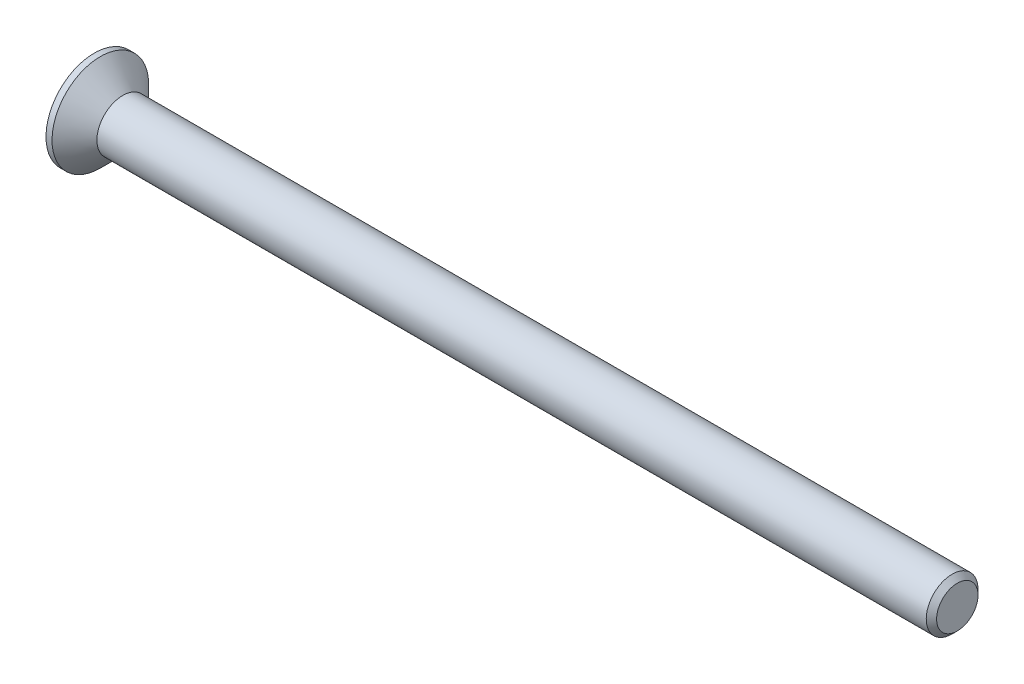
from build123d import *

# Parameters (mm, degrees)
CHAMFER1_SIZE      = 0.3
CUT_EXTRUDE1_DEPTH = 1.25


with BuildPart() as part:
    # Sketch1 → Revolve1 (revolve)
    with BuildSketch(Plane.XY, mode=Mode.PRIVATE) as revolve1_sk:
        Polygon((-1.65, 2.8), (-1.65, 0), (48.35, 0), (48.35, 1.5), (0, 1.5), (-1.3, 2.8), align=None)
    revolve(revolve1_sk.sketch.rotate(Axis((-1.65, 0, 0), (1, 0, 0)), 180), axis=Axis((-1.65, 0, 0), (1, 0, 0)))

    # Chamfer1
    chamfer1_edges = [part.edges().sort_by_distance(p)[0] for p in [
        (48.35, 1.5, 0),
    ]]
    chamfer(chamfer1_edges, length=CHAMFER1_SIZE)

    # Sketch2 → Cut-Extrude1 (cut)
    with BuildSketch(Plane.ZY.offset(1.65)):
        Polygon((-0.365, 1.45), (0.365, 1.45), (0.365, 0.365), (1.45, 0.365), (1.45, -0.365), (0.365, -0.365), (0.365, -1.45), (-0.365, -1.45), (-0.365, -0.365), (-1.45, -0.365), (-1.45, 0.365), (-0.365, 0.365), align=None)
    extrude(amount=-CUT_EXTRUDE1_DEPTH, mode=Mode.SUBTRACT)


solid = part.part
